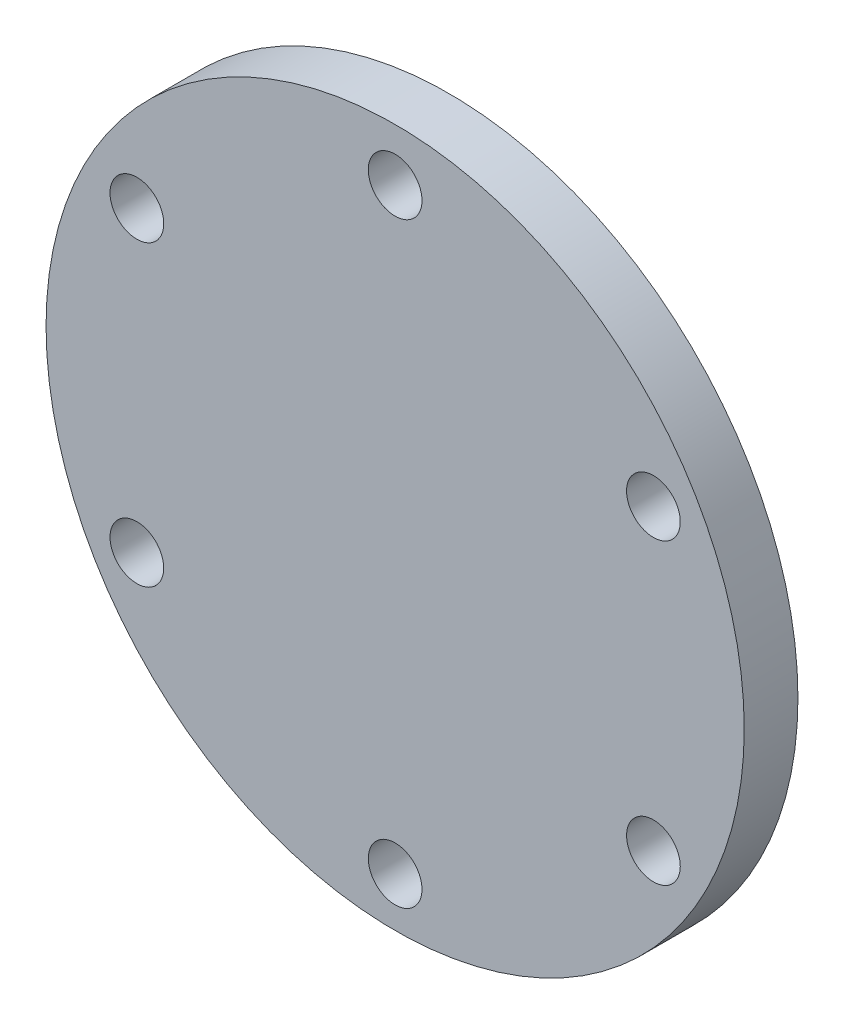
ISO-10303-21;
HEADER;
FILE_DESCRIPTION(('STEP AP214'),'2;1');
FILE_NAME('part.step','',(''),(''),'','','');
FILE_SCHEMA(('AUTOMOTIVE_DESIGN { 1 0 10303 214 1 1 1 1 }'));
ENDSEC;
DATA;
#1=APPLICATION_CONTEXT('core data for automotive mechanical design processes');
#2=APPLICATION_PROTOCOL_DEFINITION('international standard','automotive_design',2000,#1);
#3=PRODUCT_CONTEXT('',#1,'mechanical');
#4=PRODUCT('Part','Part','',(#3));
#5=PRODUCT_RELATED_PRODUCT_CATEGORY('part','',(#4));
#6=PRODUCT_DEFINITION_FORMATION('','',#4);
#7=PRODUCT_DEFINITION_CONTEXT('part definition',#1,'design');
#8=PRODUCT_DEFINITION('design','',#6,#7);
#9=PRODUCT_DEFINITION_SHAPE('','',#8);
#10=(LENGTH_UNIT() NAMED_UNIT(*) SI_UNIT(.MILLI.,.METRE.));
#11=(NAMED_UNIT(*) PLANE_ANGLE_UNIT() SI_UNIT($,.RADIAN.));
#12=(NAMED_UNIT(*) SI_UNIT($,.STERADIAN.) SOLID_ANGLE_UNIT());
#13=UNCERTAINTY_MEASURE_WITH_UNIT(LENGTH_MEASURE(1.E-05),#10,'distance_accuracy_value','');
#14=(GEOMETRIC_REPRESENTATION_CONTEXT(3) GLOBAL_UNCERTAINTY_ASSIGNED_CONTEXT((#13)) GLOBAL_UNIT_ASSIGNED_CONTEXT((#10,
#11,#12)) REPRESENTATION_CONTEXT('',''));
#15=CARTESIAN_POINT('',(0.,0.,0.));
#16=DIRECTION('',(0.,0.,1.));
#17=DIRECTION('',(1.,0.,0.));
#18=AXIS2_PLACEMENT_3D('',#15,#16,#17);
#19=CARTESIAN_POINT('',(0.,0.,6.35));
#20=DIRECTION('',(0.,0.,-1.));
#21=DIRECTION('',(-1.,0.,0.));
#22=AXIS2_PLACEMENT_3D('',#19,#20,#21);
#23=CYLINDRICAL_SURFACE('',#22,41.275);
#24=CARTESIAN_POINT('',(0.,0.,6.35));
#25=DIRECTION('',(0.,0.,1.));
#26=DIRECTION('',(1.,0.,0.));
#27=AXIS2_PLACEMENT_3D('',#24,#25,#26);
#28=CIRCLE('',#27,41.275);
#29=CARTESIAN_POINT('',(41.275,0.,6.35));
#30=VERTEX_POINT('',#29);
#31=EDGE_CURVE('E10',#30,#30,#28,.T.);
#32=ORIENTED_EDGE('',*,*,#31,.F.);
#33=EDGE_LOOP('',(#32));
#34=FACE_BOUND('',#33,.T.);
#35=CARTESIAN_POINT('',(0.,0.,0.));
#36=DIRECTION('',(0.,0.,1.));
#37=DIRECTION('',(1.,0.,0.));
#38=AXIS2_PLACEMENT_3D('',#35,#36,#37);
#39=CIRCLE('',#38,41.275);
#40=CARTESIAN_POINT('',(41.275,0.,0.));
#41=VERTEX_POINT('',#40);
#42=EDGE_CURVE('E38',#41,#41,#39,.T.);
#43=ORIENTED_EDGE('',*,*,#42,.T.);
#44=EDGE_LOOP('',(#43));
#45=FACE_BOUND('',#44,.T.);
#46=ADVANCED_FACE('F35',(#34,#45),#23,.T.);
#47=CARTESIAN_POINT('',(0.,0.,6.35));
#48=DIRECTION('',(0.,0.,1.));
#49=DIRECTION('',(1.,0.,0.));
#50=AXIS2_PLACEMENT_3D('',#47,#48,#49);
#51=PLANE('',#50);
#52=CARTESIAN_POINT('',(30.5366124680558,17.4216785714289,6.35));
#53=DIRECTION('',(0.,0.,1.));
#54=DIRECTION('',(0.50000000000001,-0.866025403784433,0.));
#55=AXIS2_PLACEMENT_3D('',#52,#53,#54);
#56=CIRCLE('',#55,3.175);
#57=CARTESIAN_POINT('',(32.1241124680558,14.6720479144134,6.35));
#58=VERTEX_POINT('',#57);
#59=EDGE_CURVE('E59',#58,#58,#56,.T.);
#60=ORIENTED_EDGE('',*,*,#59,.F.);
#61=EDGE_LOOP('',(#60));
#62=FACE_BOUND('',#61,.T.);
#63=CARTESIAN_POINT('',(30.5366124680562,-17.838964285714,6.35));
#64=DIRECTION('',(0.,0.,1.));
#65=DIRECTION('',(-0.499999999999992,-0.866025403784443,0.));
#66=AXIS2_PLACEMENT_3D('',#63,#64,#65);
#67=CIRCLE('',#66,3.175);
#68=CARTESIAN_POINT('',(28.9491124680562,-20.5885949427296,6.35));
#69=VERTEX_POINT('',#68);
#70=EDGE_CURVE('E65',#69,#69,#67,.T.);
#71=ORIENTED_EDGE('',*,*,#70,.F.);
#72=EDGE_LOOP('',(#71));
#73=FACE_BOUND('',#72,.T.);
#74=CARTESIAN_POINT('',(0.,-35.4692857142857,6.35));
#75=DIRECTION('',(0.,0.,1.));
#76=DIRECTION('',(-1.,0.,0.));
#77=AXIS2_PLACEMENT_3D('',#74,#75,#76);
#78=CIRCLE('',#77,3.175);
#79=CARTESIAN_POINT('',(-3.17499999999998,-35.4692857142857,6.35));
#80=VERTEX_POINT('',#79);
#81=EDGE_CURVE('E71',#80,#80,#78,.T.);
#82=ORIENTED_EDGE('',*,*,#81,.F.);
#83=EDGE_LOOP('',(#82));
#84=FACE_BOUND('',#83,.T.);
#85=CARTESIAN_POINT('',(-30.5366124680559,-17.8389642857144,6.35));
#86=DIRECTION('',(0.,0.,1.));
#87=DIRECTION('',(-0.500000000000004,0.866025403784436,0.));
#88=AXIS2_PLACEMENT_3D('',#85,#86,#87);
#89=CIRCLE('',#88,3.175);
#90=CARTESIAN_POINT('',(-32.1241124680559,-15.0893336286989,6.35));
#91=VERTEX_POINT('',#90);
#92=EDGE_CURVE('E77',#91,#91,#89,.T.);
#93=ORIENTED_EDGE('',*,*,#92,.F.);
#94=EDGE_LOOP('',(#93));
#95=FACE_BOUND('',#94,.T.);
#96=CARTESIAN_POINT('',(-30.5366124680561,17.4216785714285,6.35));
#97=DIRECTION('',(0.,0.,1.));
#98=DIRECTION('',(0.499999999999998,0.86602540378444,0.));
#99=AXIS2_PLACEMENT_3D('',#96,#97,#98);
#100=CIRCLE('',#99,3.175);
#101=CARTESIAN_POINT('',(-28.9491124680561,20.1713092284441,6.35));
#102=VERTEX_POINT('',#101);
#103=EDGE_CURVE('E53',#102,#102,#100,.T.);
#104=ORIENTED_EDGE('',*,*,#103,.F.);
#105=EDGE_LOOP('',(#104));
#106=FACE_BOUND('',#105,.T.);
#107=CARTESIAN_POINT('',(0.,35.052,6.35));
#108=DIRECTION('',(0.,0.,1.));
#109=DIRECTION('',(1.,0.,0.));
#110=AXIS2_PLACEMENT_3D('',#107,#108,#109);
#111=CIRCLE('',#110,3.175);
#112=CARTESIAN_POINT('',(3.17499999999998,35.052,6.35));
#113=VERTEX_POINT('',#112);
#114=EDGE_CURVE('E47',#113,#113,#111,.T.);
#115=ORIENTED_EDGE('',*,*,#114,.F.);
#116=EDGE_LOOP('',(#115));
#117=FACE_BOUND('',#116,.T.);
#118=ORIENTED_EDGE('',*,*,#31,.T.);
#119=EDGE_LOOP('',(#118));
#120=FACE_BOUND('',#119,.T.);
#121=ADVANCED_FACE('F94',(#62,#73,#84,#95,#106,#117,#120),#51,.T.);
#122=CARTESIAN_POINT('',(0.,0.,0.));
#123=DIRECTION('',(0.,0.,1.));
#124=DIRECTION('',(1.,0.,0.));
#125=AXIS2_PLACEMENT_3D('',#122,#123,#124);
#126=PLANE('',#125);
#127=CARTESIAN_POINT('',(30.5366124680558,17.4216785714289,0.));
#128=DIRECTION('',(0.,0.,1.));
#129=DIRECTION('',(0.50000000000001,-0.866025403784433,0.));
#130=AXIS2_PLACEMENT_3D('',#127,#128,#129);
#131=CIRCLE('',#130,3.175);
#132=CARTESIAN_POINT('',(32.1241124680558,14.6720479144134,0.));
#133=VERTEX_POINT('',#132);
#134=EDGE_CURVE('E62',#133,#133,#131,.T.);
#135=ORIENTED_EDGE('',*,*,#134,.T.);
#136=EDGE_LOOP('',(#135));
#137=FACE_BOUND('',#136,.T.);
#138=CARTESIAN_POINT('',(30.5366124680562,-17.838964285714,0.));
#139=DIRECTION('',(0.,0.,1.));
#140=DIRECTION('',(-0.499999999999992,-0.866025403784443,0.));
#141=AXIS2_PLACEMENT_3D('',#138,#139,#140);
#142=CIRCLE('',#141,3.175);
#143=CARTESIAN_POINT('',(28.9491124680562,-20.5885949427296,0.));
#144=VERTEX_POINT('',#143);
#145=EDGE_CURVE('E68',#144,#144,#142,.T.);
#146=ORIENTED_EDGE('',*,*,#145,.T.);
#147=EDGE_LOOP('',(#146));
#148=FACE_BOUND('',#147,.T.);
#149=CARTESIAN_POINT('',(0.,-35.4692857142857,0.));
#150=DIRECTION('',(0.,0.,1.));
#151=DIRECTION('',(-1.,0.,0.));
#152=AXIS2_PLACEMENT_3D('',#149,#150,#151);
#153=CIRCLE('',#152,3.175);
#154=CARTESIAN_POINT('',(-3.17499999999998,-35.4692857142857,0.));
#155=VERTEX_POINT('',#154);
#156=EDGE_CURVE('E74',#155,#155,#153,.T.);
#157=ORIENTED_EDGE('',*,*,#156,.T.);
#158=EDGE_LOOP('',(#157));
#159=FACE_BOUND('',#158,.T.);
#160=CARTESIAN_POINT('',(-30.5366124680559,-17.8389642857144,0.));
#161=DIRECTION('',(0.,0.,1.));
#162=DIRECTION('',(-0.500000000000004,0.866025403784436,0.));
#163=AXIS2_PLACEMENT_3D('',#160,#161,#162);
#164=CIRCLE('',#163,3.175);
#165=CARTESIAN_POINT('',(-32.1241124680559,-15.0893336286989,0.));
#166=VERTEX_POINT('',#165);
#167=EDGE_CURVE('E56',#166,#166,#164,.T.);
#168=ORIENTED_EDGE('',*,*,#167,.T.);
#169=EDGE_LOOP('',(#168));
#170=FACE_BOUND('',#169,.T.);
#171=CARTESIAN_POINT('',(-30.5366124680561,17.4216785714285,0.));
#172=DIRECTION('',(0.,0.,1.));
#173=DIRECTION('',(0.499999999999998,0.86602540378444,0.));
#174=AXIS2_PLACEMENT_3D('',#171,#172,#173);
#175=CIRCLE('',#174,3.175);
#176=CARTESIAN_POINT('',(-28.9491124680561,20.1713092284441,0.));
#177=VERTEX_POINT('',#176);
#178=EDGE_CURVE('E50',#177,#177,#175,.T.);
#179=ORIENTED_EDGE('',*,*,#178,.T.);
#180=EDGE_LOOP('',(#179));
#181=FACE_BOUND('',#180,.T.);
#182=CARTESIAN_POINT('',(0.,35.052,0.));
#183=DIRECTION('',(0.,0.,1.));
#184=DIRECTION('',(1.,0.,0.));
#185=AXIS2_PLACEMENT_3D('',#182,#183,#184);
#186=CIRCLE('',#185,3.175);
#187=CARTESIAN_POINT('',(3.17499999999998,35.052,0.));
#188=VERTEX_POINT('',#187);
#189=EDGE_CURVE('E45',#188,#188,#186,.T.);
#190=ORIENTED_EDGE('',*,*,#189,.T.);
#191=EDGE_LOOP('',(#190));
#192=FACE_BOUND('',#191,.T.);
#193=ORIENTED_EDGE('',*,*,#42,.F.);
#194=EDGE_LOOP('',(#193));
#195=FACE_BOUND('',#194,.T.);
#196=ADVANCED_FACE('F83',(#137,#148,#159,#170,#181,#192,#195),#126,.F.);
#197=CARTESIAN_POINT('',(0.,35.052,0.));
#198=DIRECTION('',(0.,0.,1.));
#199=DIRECTION('',(1.,0.,0.));
#200=AXIS2_PLACEMENT_3D('',#197,#198,#199);
#201=CYLINDRICAL_SURFACE('',#200,3.175);
#202=ORIENTED_EDGE('',*,*,#189,.F.);
#203=EDGE_LOOP('',(#202));
#204=FACE_BOUND('',#203,.T.);
#205=ORIENTED_EDGE('',*,*,#114,.T.);
#206=EDGE_LOOP('',(#205));
#207=FACE_BOUND('',#206,.T.);
#208=ADVANCED_FACE('F103',(#204,#207),#201,.F.);
#209=CARTESIAN_POINT('',(-30.5366124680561,17.4216785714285,0.));
#210=DIRECTION('',(0.,0.,1.));
#211=DIRECTION('',(1.,0.,0.));
#212=AXIS2_PLACEMENT_3D('',#209,#210,#211);
#213=CYLINDRICAL_SURFACE('',#212,3.175);
#214=ORIENTED_EDGE('',*,*,#178,.F.);
#215=EDGE_LOOP('',(#214));
#216=FACE_BOUND('',#215,.T.);
#217=ORIENTED_EDGE('',*,*,#103,.T.);
#218=EDGE_LOOP('',(#217));
#219=FACE_BOUND('',#218,.T.);
#220=ADVANCED_FACE('F90',(#216,#219),#213,.F.);
#221=CARTESIAN_POINT('',(-30.5366124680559,-17.8389642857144,0.));
#222=DIRECTION('',(0.,0.,1.));
#223=DIRECTION('',(1.,0.,0.));
#224=AXIS2_PLACEMENT_3D('',#221,#222,#223);
#225=CYLINDRICAL_SURFACE('',#224,3.175);
#226=ORIENTED_EDGE('',*,*,#167,.F.);
#227=EDGE_LOOP('',(#226));
#228=FACE_BOUND('',#227,.T.);
#229=ORIENTED_EDGE('',*,*,#92,.T.);
#230=EDGE_LOOP('',(#229));
#231=FACE_BOUND('',#230,.T.);
#232=ADVANCED_FACE('F86',(#228,#231),#225,.F.);
#233=CARTESIAN_POINT('',(0.,-35.4692857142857,0.));
#234=DIRECTION('',(0.,0.,1.));
#235=DIRECTION('',(1.,0.,0.));
#236=AXIS2_PLACEMENT_3D('',#233,#234,#235);
#237=CYLINDRICAL_SURFACE('',#236,3.175);
#238=ORIENTED_EDGE('',*,*,#156,.F.);
#239=EDGE_LOOP('',(#238));
#240=FACE_BOUND('',#239,.T.);
#241=ORIENTED_EDGE('',*,*,#81,.T.);
#242=EDGE_LOOP('',(#241));
#243=FACE_BOUND('',#242,.T.);
#244=ADVANCED_FACE('F89',(#240,#243),#237,.F.);
#245=CARTESIAN_POINT('',(30.5366124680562,-17.838964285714,0.));
#246=DIRECTION('',(0.,0.,1.));
#247=DIRECTION('',(1.,0.,0.));
#248=AXIS2_PLACEMENT_3D('',#245,#246,#247);
#249=CYLINDRICAL_SURFACE('',#248,3.175);
#250=ORIENTED_EDGE('',*,*,#145,.F.);
#251=EDGE_LOOP('',(#250));
#252=FACE_BOUND('',#251,.T.);
#253=ORIENTED_EDGE('',*,*,#70,.T.);
#254=EDGE_LOOP('',(#253));
#255=FACE_BOUND('',#254,.T.);
#256=ADVANCED_FACE('F152',(#252,#255),#249,.F.);
#257=CARTESIAN_POINT('',(30.5366124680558,17.4216785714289,0.));
#258=DIRECTION('',(0.,0.,1.));
#259=DIRECTION('',(1.,0.,0.));
#260=AXIS2_PLACEMENT_3D('',#257,#258,#259);
#261=CYLINDRICAL_SURFACE('',#260,3.175);
#262=ORIENTED_EDGE('',*,*,#134,.F.);
#263=EDGE_LOOP('',(#262));
#264=FACE_BOUND('',#263,.T.);
#265=ORIENTED_EDGE('',*,*,#59,.T.);
#266=EDGE_LOOP('',(#265));
#267=FACE_BOUND('',#266,.T.);
#268=ADVANCED_FACE('F162',(#264,#267),#261,.F.);
#269=CLOSED_SHELL('',(#46,#121,#196,#208,#220,#232,#244,#256,#268));
#270=MANIFOLD_SOLID_BREP('B2',#269);
#271=ADVANCED_BREP_SHAPE_REPRESENTATION('',(#18,#270),#14);
#272=SHAPE_DEFINITION_REPRESENTATION(#9,#271);
ENDSEC;
END-ISO-10303-21;
